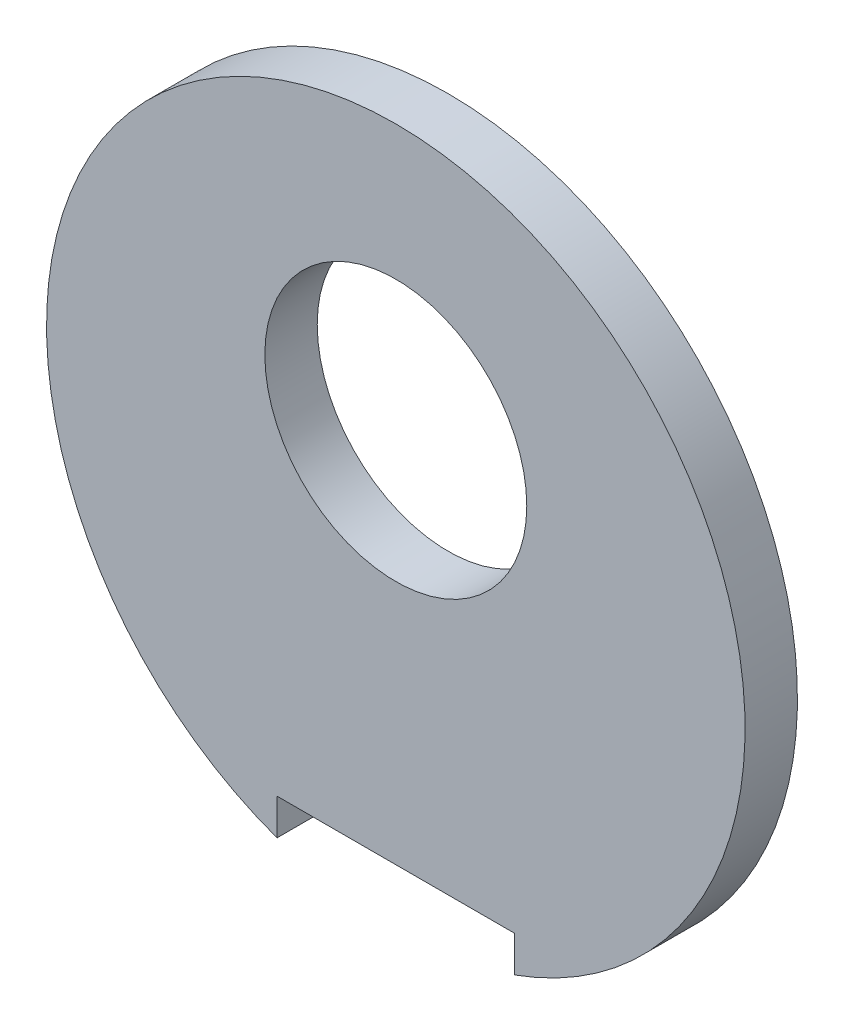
from build123d import *

# Parameters (mm, degrees)
SKETCH1_R          = 25.4
EXTRUDE1_DEPTH     = 3.81
SKETCH2_R          = 9.525
CUT_EXTRUDE2_DEPTH = 37.122515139
SKETCH3_W          = 17.272
SKETCH3_H          = 6.536364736
CUT_EXTRUDE3_DEPTH = 37.122515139


with BuildPart() as part:
    # Sketch1 → Extrude1 (new body)
    with BuildSketch(Plane.XY):
        with Locations(Location((0, 0, 0), (0, 0, 180))):
            Circle(SKETCH1_R)
    extrude(amount=EXTRUDE1_DEPTH)

    # Sketch2 → Cut-Extrude2 (cut, through all)
    with BuildSketch(Plane.XY):
        with Locations(Location((0, 6.096, 0), (0, 0, 180))):
            Circle(SKETCH2_R)
    extrude(amount=CUT_EXTRUDE2_DEPTH, mode=Mode.SUBTRACT)

    # Sketch3 → Cut-Extrude3 (cut, through all)
    with BuildSketch(Plane.XY):
        with Locations((0, -24.527982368)):
            Rectangle(SKETCH3_W, SKETCH3_H)
    extrude(amount=CUT_EXTRUDE3_DEPTH, mode=Mode.SUBTRACT)


solid = part.part
